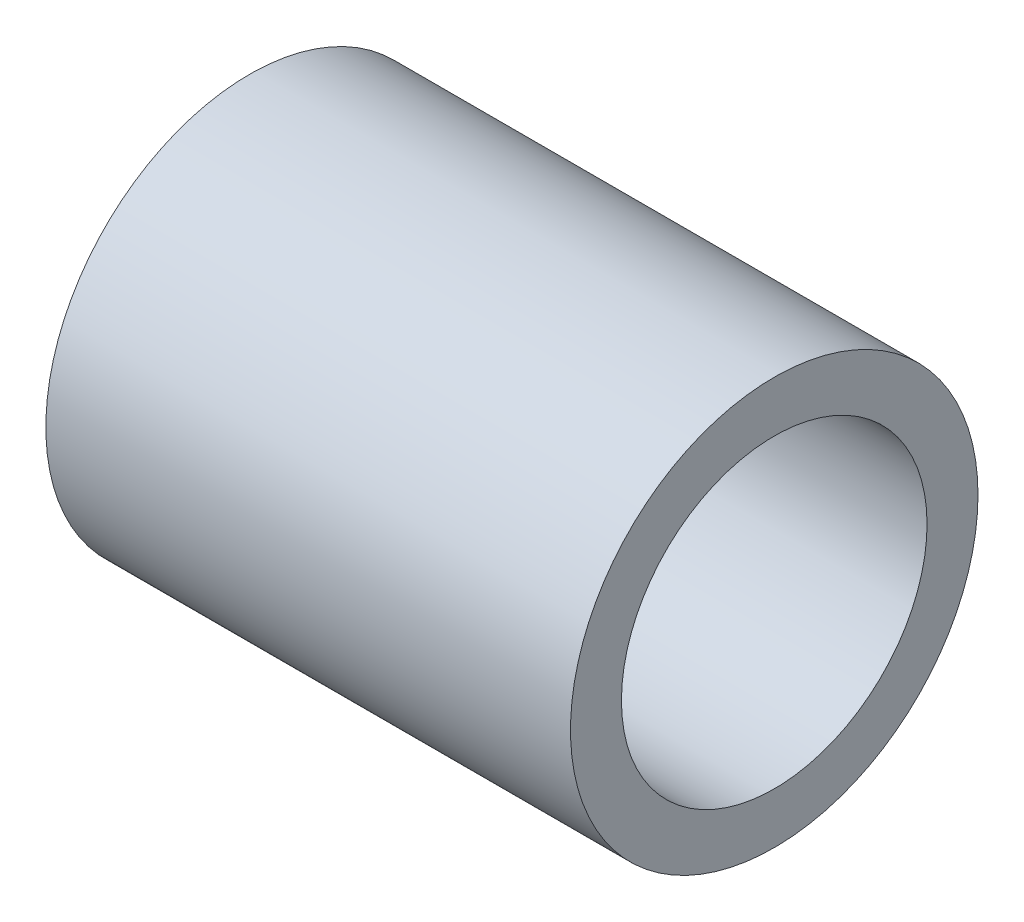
from build123d import *


with BuildPart() as part:
    # Esquisse1 → Base-R_volution (revolve)
    with BuildSketch(Plane.XY, mode=Mode.PRIVATE) as base_r_volution_sk:
        Polygon((-20, 26), (-20, 25.5), (-19.5, 25), (-9.7, 25), (-9.7, 26), align=None)
    revolve(base_r_volution_sk.sketch.rotate(Axis((-20, 22, 0), (1, 0, 0)), 270), axis=Axis((-20, 22, 0), (1, 0, 0)))


solid = part.part
